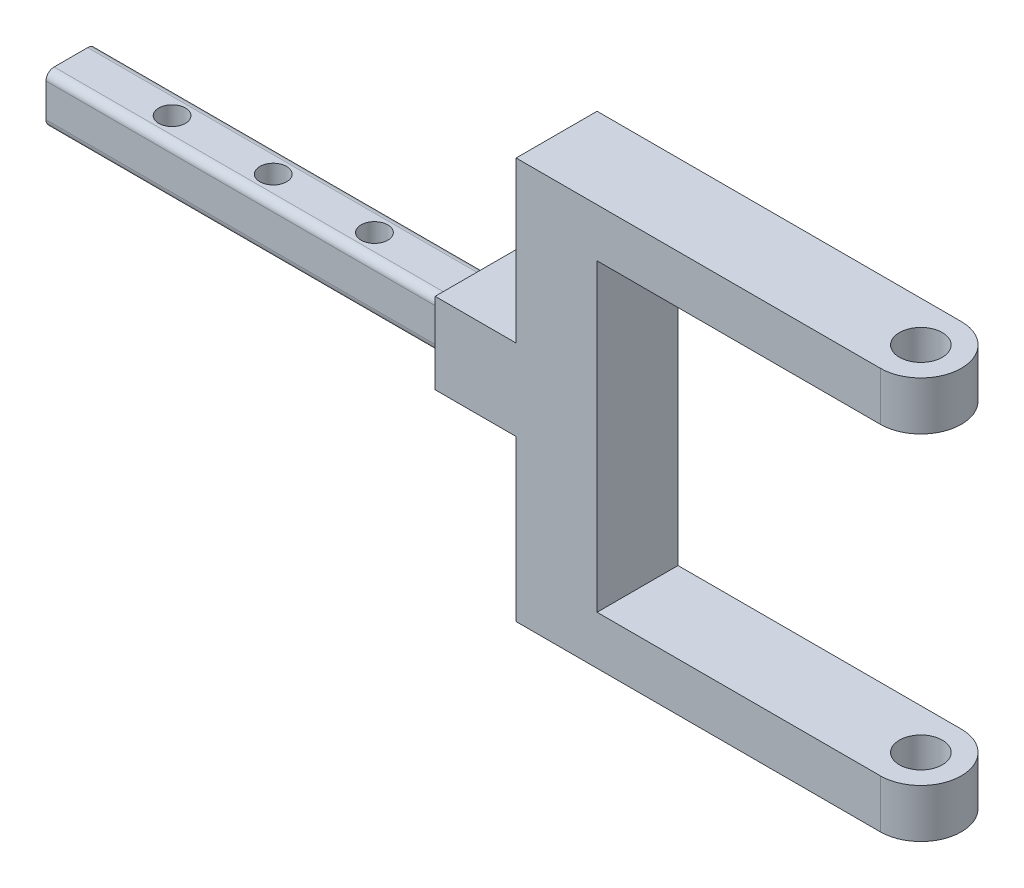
ISO-10303-21;
HEADER;
FILE_DESCRIPTION(('STEP AP214'),'2;1');
FILE_NAME('part.step','',(''),(''),'','','');
FILE_SCHEMA(('AUTOMOTIVE_DESIGN { 1 0 10303 214 1 1 1 1 }'));
ENDSEC;
DATA;
#1=APPLICATION_CONTEXT('core data for automotive mechanical design processes');
#2=APPLICATION_PROTOCOL_DEFINITION('international standard','automotive_design',2000,#1);
#3=PRODUCT_CONTEXT('',#1,'mechanical');
#4=PRODUCT('Part','Part','',(#3));
#5=PRODUCT_RELATED_PRODUCT_CATEGORY('part','',(#4));
#6=PRODUCT_DEFINITION_FORMATION('','',#4);
#7=PRODUCT_DEFINITION_CONTEXT('part definition',#1,'design');
#8=PRODUCT_DEFINITION('design','',#6,#7);
#9=PRODUCT_DEFINITION_SHAPE('','',#8);
#10=(LENGTH_UNIT() NAMED_UNIT(*) SI_UNIT(.MILLI.,.METRE.));
#11=(NAMED_UNIT(*) PLANE_ANGLE_UNIT() SI_UNIT($,.RADIAN.));
#12=(NAMED_UNIT(*) SI_UNIT($,.STERADIAN.) SOLID_ANGLE_UNIT());
#13=UNCERTAINTY_MEASURE_WITH_UNIT(LENGTH_MEASURE(1.E-05),#10,'distance_accuracy_value','');
#14=(GEOMETRIC_REPRESENTATION_CONTEXT(3) GLOBAL_UNCERTAINTY_ASSIGNED_CONTEXT((#13)) GLOBAL_UNIT_ASSIGNED_CONTEXT((#10,
#11,#12)) REPRESENTATION_CONTEXT('',''));
#15=CARTESIAN_POINT('',(0.,0.,0.));
#16=DIRECTION('',(0.,0.,1.));
#17=DIRECTION('',(1.,0.,0.));
#18=AXIS2_PLACEMENT_3D('',#15,#16,#17);
#19=CARTESIAN_POINT('',(40.,24.8,10.));
#20=DIRECTION('',(0.,-1.,0.));
#21=DIRECTION('',(1.,0.,0.));
#22=AXIS2_PLACEMENT_3D('',#19,#20,#21);
#23=PLANE('',#22);
#24=CARTESIAN_POINT('',(35.,24.8,5.));
#25=DIRECTION('',(0.,1.,0.));
#26=DIRECTION('',(-1.,0.,0.));
#27=AXIS2_PLACEMENT_3D('',#24,#25,#26);
#28=CIRCLE('',#27,2.65);
#29=CARTESIAN_POINT('',(32.35,24.8,5.));
#30=VERTEX_POINT('',#29);
#31=EDGE_CURVE('E415',#30,#30,#28,.T.);
#32=ORIENTED_EDGE('',*,*,#31,.F.);
#33=EDGE_LOOP('',(#32));
#34=FACE_BOUND('',#33,.T.);
#35=DIRECTION('',(-1.,0.,0.));
#36=VECTOR('',#35,1.);
#37=CARTESIAN_POINT('',(40.,24.8,10.));
#38=LINE('',#37,#36);
#39=CARTESIAN_POINT('',(35.,24.8,10.));
#40=VERTEX_POINT('',#39);
#41=CARTESIAN_POINT('',(-10.,24.8,10.));
#42=VERTEX_POINT('',#41);
#43=EDGE_CURVE('E268',#40,#42,#38,.T.);
#44=ORIENTED_EDGE('',*,*,#43,.F.);
#45=CARTESIAN_POINT('',(35.,24.8,5.));
#46=DIRECTION('',(0.,1.,0.));
#47=DIRECTION('',(-1.,0.,0.));
#48=AXIS2_PLACEMENT_3D('',#45,#46,#47);
#49=CIRCLE('',#48,5.);
#50=CARTESIAN_POINT('',(35.,24.8,0.));
#51=VERTEX_POINT('',#50);
#52=EDGE_CURVE('E225',#40,#51,#49,.T.);
#53=ORIENTED_EDGE('',*,*,#52,.T.);
#54=DIRECTION('',(-1.,0.,0.));
#55=VECTOR('',#54,1.);
#56=CARTESIAN_POINT('',(40.,24.8,0.));
#57=LINE('',#56,#55);
#58=CARTESIAN_POINT('',(-10.,24.8,0.));
#59=VERTEX_POINT('',#58);
#60=EDGE_CURVE('E254',#51,#59,#57,.T.);
#61=ORIENTED_EDGE('',*,*,#60,.T.);
#62=DIRECTION('',(0.,0.,-1.));
#63=VECTOR('',#62,1.);
#64=CARTESIAN_POINT('',(-10.,24.8,10.));
#65=LINE('',#64,#63);
#66=EDGE_CURVE('E276',#42,#59,#65,.T.);
#67=ORIENTED_EDGE('',*,*,#66,.F.);
#68=EDGE_LOOP('',(#44,#53,#61,#67));
#69=FACE_BOUND('',#68,.T.);
#70=ADVANCED_FACE('F78',(#34,#69),#23,.F.);
#71=CARTESIAN_POINT('',(-9.99999999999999,-24.8,10.));
#72=DIRECTION('',(0.,1.,0.));
#73=DIRECTION('',(-1.,0.,0.));
#74=AXIS2_PLACEMENT_3D('',#71,#72,#73);
#75=PLANE('',#74);
#76=CARTESIAN_POINT('',(35.,-24.8,5.));
#77=DIRECTION('',(0.,1.,0.));
#78=DIRECTION('',(-1.,0.,0.));
#79=AXIS2_PLACEMENT_3D('',#76,#77,#78);
#80=CIRCLE('',#79,2.65);
#81=CARTESIAN_POINT('',(32.35,-24.8,5.));
#82=VERTEX_POINT('',#81);
#83=EDGE_CURVE('E418',#82,#82,#80,.T.);
#84=ORIENTED_EDGE('',*,*,#83,.T.);
#85=EDGE_LOOP('',(#84));
#86=FACE_BOUND('',#85,.T.);
#87=CARTESIAN_POINT('',(35.,-24.8,5.));
#88=DIRECTION('',(0.,1.,0.));
#89=DIRECTION('',(-1.,0.,0.));
#90=AXIS2_PLACEMENT_3D('',#87,#88,#89);
#91=CIRCLE('',#90,5.);
#92=CARTESIAN_POINT('',(35.,-24.8,10.));
#93=VERTEX_POINT('',#92);
#94=CARTESIAN_POINT('',(35.,-24.8,0.));
#95=VERTEX_POINT('',#94);
#96=EDGE_CURVE('E214',#93,#95,#91,.T.);
#97=ORIENTED_EDGE('',*,*,#96,.F.);
#98=DIRECTION('',(1.,0.,0.));
#99=VECTOR('',#98,1.);
#100=CARTESIAN_POINT('',(-9.99999999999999,-24.8,10.));
#101=LINE('',#100,#99);
#102=CARTESIAN_POINT('',(-9.99999999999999,-24.8,10.));
#103=VERTEX_POINT('',#102);
#104=EDGE_CURVE('E219',#103,#93,#101,.T.);
#105=ORIENTED_EDGE('',*,*,#104,.F.);
#106=DIRECTION('',(0.,0.,-1.));
#107=VECTOR('',#106,1.);
#108=CARTESIAN_POINT('',(-9.99999999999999,-24.8,10.));
#109=LINE('',#108,#107);
#110=CARTESIAN_POINT('',(-9.99999999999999,-24.8,0.));
#111=VERTEX_POINT('',#110);
#112=EDGE_CURVE('E274',#103,#111,#109,.T.);
#113=ORIENTED_EDGE('',*,*,#112,.T.);
#114=DIRECTION('',(1.,0.,0.));
#115=VECTOR('',#114,1.);
#116=CARTESIAN_POINT('',(-9.99999999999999,-24.8,0.));
#117=LINE('',#116,#115);
#118=EDGE_CURVE('E221',#111,#95,#117,.T.);
#119=ORIENTED_EDGE('',*,*,#118,.T.);
#120=EDGE_LOOP('',(#97,#105,#113,#119));
#121=FACE_BOUND('',#120,.T.);
#122=ADVANCED_FACE('F216',(#86,#121),#75,.F.);
#123=CARTESIAN_POINT('',(40.,-18.8,10.));
#124=DIRECTION('',(0.,-1.,0.));
#125=DIRECTION('',(1.,0.,0.));
#126=AXIS2_PLACEMENT_3D('',#123,#124,#125);
#127=PLANE('',#126);
#128=CARTESIAN_POINT('',(35.,-18.8,5.));
#129=DIRECTION('',(0.,-1.,0.));
#130=DIRECTION('',(1.,0.,0.));
#131=AXIS2_PLACEMENT_3D('',#128,#129,#130);
#132=CIRCLE('',#131,2.65);
#133=CARTESIAN_POINT('',(37.65,-18.8,5.));
#134=VERTEX_POINT('',#133);
#135=EDGE_CURVE('E285',#134,#134,#132,.T.);
#136=ORIENTED_EDGE('',*,*,#135,.T.);
#137=EDGE_LOOP('',(#136));
#138=FACE_BOUND('',#137,.T.);
#139=DIRECTION('',(-1.,0.,0.));
#140=VECTOR('',#139,1.);
#141=CARTESIAN_POINT('',(40.,-18.8,10.));
#142=LINE('',#141,#140);
#143=CARTESIAN_POINT('',(35.,-18.8,10.));
#144=VERTEX_POINT('',#143);
#145=CARTESIAN_POINT('',(0.,-18.8,10.));
#146=VERTEX_POINT('',#145);
#147=EDGE_CURVE('E240',#144,#146,#142,.T.);
#148=ORIENTED_EDGE('',*,*,#147,.F.);
#149=CARTESIAN_POINT('',(35.,-18.8,5.));
#150=DIRECTION('',(0.,-1.,0.));
#151=DIRECTION('',(1.,0.,0.));
#152=AXIS2_PLACEMENT_3D('',#149,#150,#151);
#153=CIRCLE('',#152,5.);
#154=CARTESIAN_POINT('',(35.,-18.8,0.));
#155=VERTEX_POINT('',#154);
#156=EDGE_CURVE('E231',#155,#144,#153,.T.);
#157=ORIENTED_EDGE('',*,*,#156,.F.);
#158=DIRECTION('',(-1.,0.,0.));
#159=VECTOR('',#158,1.);
#160=CARTESIAN_POINT('',(40.,-18.8,0.));
#161=LINE('',#160,#159);
#162=CARTESIAN_POINT('',(0.,-18.8,0.));
#163=VERTEX_POINT('',#162);
#164=EDGE_CURVE('E261',#155,#163,#161,.T.);
#165=ORIENTED_EDGE('',*,*,#164,.T.);
#166=DIRECTION('',(0.,0.,-1.));
#167=VECTOR('',#166,1.);
#168=CARTESIAN_POINT('',(0.,-18.8,10.));
#169=LINE('',#168,#167);
#170=EDGE_CURVE('E271',#146,#163,#169,.T.);
#171=ORIENTED_EDGE('',*,*,#170,.F.);
#172=EDGE_LOOP('',(#148,#157,#165,#171));
#173=FACE_BOUND('',#172,.T.);
#174=ADVANCED_FACE('F429',(#138,#173),#127,.F.);
#175=CARTESIAN_POINT('',(0.,18.8,10.));
#176=DIRECTION('',(0.,1.,0.));
#177=DIRECTION('',(0.,0.,1.));
#178=AXIS2_PLACEMENT_3D('',#175,#176,#177);
#179=PLANE('',#178);
#180=CARTESIAN_POINT('',(35.,18.8,5.));
#181=DIRECTION('',(0.,1.,0.));
#182=DIRECTION('',(0.,0.,1.));
#183=AXIS2_PLACEMENT_3D('',#180,#181,#182);
#184=CIRCLE('',#183,2.65);
#185=CARTESIAN_POINT('',(35.,18.8,7.65));
#186=VERTEX_POINT('',#185);
#187=EDGE_CURVE('E282',#186,#186,#184,.T.);
#188=ORIENTED_EDGE('',*,*,#187,.T.);
#189=EDGE_LOOP('',(#188));
#190=FACE_BOUND('',#189,.T.);
#191=CARTESIAN_POINT('',(35.,18.8,5.));
#192=DIRECTION('',(0.,1.,0.));
#193=DIRECTION('',(0.,0.,1.));
#194=AXIS2_PLACEMENT_3D('',#191,#192,#193);
#195=CIRCLE('',#194,5.);
#196=CARTESIAN_POINT('',(35.,18.8,10.));
#197=VERTEX_POINT('',#196);
#198=CARTESIAN_POINT('',(35.,18.8,0.));
#199=VERTEX_POINT('',#198);
#200=EDGE_CURVE('E423',#197,#199,#195,.T.);
#201=ORIENTED_EDGE('',*,*,#200,.F.);
#202=DIRECTION('',(1.,0.,0.));
#203=VECTOR('',#202,1.);
#204=CARTESIAN_POINT('',(0.,18.8,10.));
#205=LINE('',#204,#203);
#206=CARTESIAN_POINT('',(0.,18.8,10.));
#207=VERTEX_POINT('',#206);
#208=EDGE_CURVE('E250',#207,#197,#205,.T.);
#209=ORIENTED_EDGE('',*,*,#208,.F.);
#210=DIRECTION('',(0.,0.,-1.));
#211=VECTOR('',#210,1.);
#212=CARTESIAN_POINT('',(0.,18.8,10.));
#213=LINE('',#212,#211);
#214=CARTESIAN_POINT('',(0.,18.8,0.));
#215=VERTEX_POINT('',#214);
#216=EDGE_CURVE('E253',#207,#215,#213,.T.);
#217=ORIENTED_EDGE('',*,*,#216,.T.);
#218=DIRECTION('',(1.,0.,0.));
#219=VECTOR('',#218,1.);
#220=CARTESIAN_POINT('',(0.,18.8,0.));
#221=LINE('',#220,#219);
#222=EDGE_CURVE('E265',#215,#199,#221,.T.);
#223=ORIENTED_EDGE('',*,*,#222,.T.);
#224=EDGE_LOOP('',(#201,#209,#217,#223));
#225=FACE_BOUND('',#224,.T.);
#226=ADVANCED_FACE('F504',(#190,#225),#179,.F.);
#227=CARTESIAN_POINT('',(0.,0.,10.));
#228=DIRECTION('',(0.,0.,1.));
#229=DIRECTION('',(1.,0.,0.));
#230=AXIS2_PLACEMENT_3D('',#227,#228,#229);
#231=PLANE('',#230);
#232=ORIENTED_EDGE('',*,*,#104,.T.);
#233=DIRECTION('',(0.,1.,0.));
#234=VECTOR('',#233,1.);
#235=CARTESIAN_POINT('',(35.,-24.8,10.));
#236=LINE('',#235,#234);
#237=EDGE_CURVE('E228',#93,#144,#236,.T.);
#238=ORIENTED_EDGE('',*,*,#237,.T.);
#239=ORIENTED_EDGE('',*,*,#147,.T.);
#240=DIRECTION('',(0.,1.,0.));
#241=VECTOR('',#240,1.);
#242=CARTESIAN_POINT('',(0.,18.8,10.));
#243=LINE('',#242,#241);
#244=EDGE_CURVE('E243',#146,#207,#243,.T.);
#245=ORIENTED_EDGE('',*,*,#244,.T.);
#246=ORIENTED_EDGE('',*,*,#208,.T.);
#247=DIRECTION('',(0.,1.,0.));
#248=VECTOR('',#247,1.);
#249=CARTESIAN_POINT('',(35.,-24.8,10.));
#250=LINE('',#249,#248);
#251=EDGE_CURVE('E281',#197,#40,#250,.T.);
#252=ORIENTED_EDGE('',*,*,#251,.T.);
#253=ORIENTED_EDGE('',*,*,#43,.T.);
#254=DIRECTION('',(0.,-1.,0.));
#255=VECTOR('',#254,1.);
#256=CARTESIAN_POINT('',(-10.,24.8,10.));
#257=LINE('',#256,#255);
#258=CARTESIAN_POINT('',(-10.,5.,10.));
#259=VERTEX_POINT('',#258);
#260=EDGE_CURVE('E241',#42,#259,#257,.T.);
#261=ORIENTED_EDGE('',*,*,#260,.T.);
#262=DIRECTION('',(1.,0.,0.));
#263=VECTOR('',#262,1.);
#264=CARTESIAN_POINT('',(-20.,5.,10.));
#265=LINE('',#264,#263);
#266=CARTESIAN_POINT('',(-20.,5.,10.));
#267=VERTEX_POINT('',#266);
#268=EDGE_CURVE('E379',#267,#259,#265,.T.);
#269=ORIENTED_EDGE('',*,*,#268,.F.);
#270=DIRECTION('',(0.,1.,0.));
#271=VECTOR('',#270,1.);
#272=CARTESIAN_POINT('',(-20.,0.,10.));
#273=LINE('',#272,#271);
#274=CARTESIAN_POINT('',(-20.,-5.,10.));
#275=VERTEX_POINT('',#274);
#276=EDGE_CURVE('E368',#275,#267,#273,.T.);
#277=ORIENTED_EDGE('',*,*,#276,.F.);
#278=DIRECTION('',(1.,0.,0.));
#279=VECTOR('',#278,1.);
#280=CARTESIAN_POINT('',(-20.,-5.,10.));
#281=LINE('',#280,#279);
#282=CARTESIAN_POINT('',(-10.,-5.,10.));
#283=VERTEX_POINT('',#282);
#284=EDGE_CURVE('E382',#275,#283,#281,.T.);
#285=ORIENTED_EDGE('',*,*,#284,.T.);
#286=EDGE_CURVE('E238',#283,#103,#257,.T.);
#287=ORIENTED_EDGE('',*,*,#286,.T.);
#288=EDGE_LOOP('',(#232,#238,#239,#245,#246,#252,#253,#261,#269,#277,#285,#287));
#289=FACE_BOUND('',#288,.T.);
#290=ADVANCED_FACE('F236',(#289),#231,.T.);
#291=CARTESIAN_POINT('',(0.,0.,0.));
#292=DIRECTION('',(0.,0.,1.));
#293=DIRECTION('',(1.,0.,0.));
#294=AXIS2_PLACEMENT_3D('',#291,#292,#293);
#295=PLANE('',#294);
#296=DIRECTION('',(0.,1.,0.));
#297=VECTOR('',#296,1.);
#298=CARTESIAN_POINT('',(35.,-24.8,0.));
#299=LINE('',#298,#297);
#300=EDGE_CURVE('E224',#95,#155,#299,.T.);
#301=ORIENTED_EDGE('',*,*,#300,.F.);
#302=ORIENTED_EDGE('',*,*,#118,.F.);
#303=DIRECTION('',(0.,-1.,0.));
#304=VECTOR('',#303,1.);
#305=CARTESIAN_POINT('',(-10.,24.8,0.));
#306=LINE('',#305,#304);
#307=CARTESIAN_POINT('',(-10.,-5.,0.));
#308=VERTEX_POINT('',#307);
#309=EDGE_CURVE('E256',#308,#111,#306,.T.);
#310=ORIENTED_EDGE('',*,*,#309,.F.);
#311=DIRECTION('',(1.,0.,0.));
#312=VECTOR('',#311,1.);
#313=CARTESIAN_POINT('',(-20.,-5.,0.));
#314=LINE('',#313,#312);
#315=CARTESIAN_POINT('',(-20.,-5.,0.));
#316=VERTEX_POINT('',#315);
#317=EDGE_CURVE('E257',#316,#308,#314,.T.);
#318=ORIENTED_EDGE('',*,*,#317,.F.);
#319=DIRECTION('',(0.,-1.,0.));
#320=VECTOR('',#319,1.);
#321=CARTESIAN_POINT('',(-20.,0.,0.));
#322=LINE('',#321,#320);
#323=CARTESIAN_POINT('',(-20.,5.,0.));
#324=VERTEX_POINT('',#323);
#325=EDGE_CURVE('E362',#324,#316,#322,.T.);
#326=ORIENTED_EDGE('',*,*,#325,.F.);
#327=DIRECTION('',(1.,0.,0.));
#328=VECTOR('',#327,1.);
#329=CARTESIAN_POINT('',(-20.,5.,0.));
#330=LINE('',#329,#328);
#331=CARTESIAN_POINT('',(-10.,5.,0.));
#332=VERTEX_POINT('',#331);
#333=EDGE_CURVE('E373',#324,#332,#330,.T.);
#334=ORIENTED_EDGE('',*,*,#333,.T.);
#335=EDGE_CURVE('E258',#59,#332,#306,.T.);
#336=ORIENTED_EDGE('',*,*,#335,.F.);
#337=ORIENTED_EDGE('',*,*,#60,.F.);
#338=DIRECTION('',(0.,1.,0.));
#339=VECTOR('',#338,1.);
#340=CARTESIAN_POINT('',(35.,-24.8,0.));
#341=LINE('',#340,#339);
#342=EDGE_CURVE('E279',#199,#51,#341,.T.);
#343=ORIENTED_EDGE('',*,*,#342,.F.);
#344=ORIENTED_EDGE('',*,*,#222,.F.);
#345=DIRECTION('',(0.,1.,0.));
#346=VECTOR('',#345,1.);
#347=CARTESIAN_POINT('',(0.,18.8,0.));
#348=LINE('',#347,#346);
#349=EDGE_CURVE('E263',#163,#215,#348,.T.);
#350=ORIENTED_EDGE('',*,*,#349,.F.);
#351=ORIENTED_EDGE('',*,*,#164,.F.);
#352=EDGE_LOOP('',(#301,#302,#310,#318,#326,#334,#336,#337,#343,#344,#350,#351));
#353=FACE_BOUND('',#352,.T.);
#354=ADVANCED_FACE('F399',(#353),#295,.F.);
#355=CARTESIAN_POINT('',(-20.,0.,0.));
#356=DIRECTION('',(-1.,0.,0.));
#357=DIRECTION('',(0.,-1.,0.));
#358=AXIS2_PLACEMENT_3D('',#355,#356,#357);
#359=PLANE('',#358);
#360=ORIENTED_EDGE('',*,*,#325,.T.);
#361=DIRECTION('',(0.,0.,1.));
#362=VECTOR('',#361,1.);
#363=CARTESIAN_POINT('',(-20.,-5.,0.));
#364=LINE('',#363,#362);
#365=EDGE_CURVE('E365',#316,#275,#364,.T.);
#366=ORIENTED_EDGE('',*,*,#365,.T.);
#367=ORIENTED_EDGE('',*,*,#276,.T.);
#368=DIRECTION('',(0.,0.,1.));
#369=VECTOR('',#368,1.);
#370=CARTESIAN_POINT('',(-20.,5.,0.));
#371=LINE('',#370,#369);
#372=EDGE_CURVE('E370',#324,#267,#371,.T.);
#373=ORIENTED_EDGE('',*,*,#372,.F.);
#374=EDGE_LOOP('',(#360,#366,#367,#373));
#375=FACE_BOUND('',#374,.T.);
#376=DIRECTION('',(0.,1.,0.));
#377=VECTOR('',#376,1.);
#378=CARTESIAN_POINT('',(-20.,0.,8.075));
#379=LINE('',#378,#377);
#380=CARTESIAN_POINT('',(-20.,-2.07500000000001,8.075));
#381=VERTEX_POINT('',#380);
#382=CARTESIAN_POINT('',(-20.,2.075,8.075));
#383=VERTEX_POINT('',#382);
#384=EDGE_CURVE('E333',#381,#383,#379,.T.);
#385=ORIENTED_EDGE('',*,*,#384,.F.);
#386=CARTESIAN_POINT('',(-20.,-2.07500000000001,7.075));
#387=DIRECTION('',(-1.,0.,0.));
#388=DIRECTION('',(0.,-1.,0.));
#389=AXIS2_PLACEMENT_3D('',#386,#387,#388);
#390=CIRCLE('',#389,1.);
#391=CARTESIAN_POINT('',(-20.,-3.07500000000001,7.075));
#392=VERTEX_POINT('',#391);
#393=EDGE_CURVE('E86',#381,#392,#390,.F.);
#394=ORIENTED_EDGE('',*,*,#393,.T.);
#395=DIRECTION('',(0.,0.,-1.));
#396=VECTOR('',#395,1.);
#397=CARTESIAN_POINT('',(-20.,-3.07500000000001,0.));
#398=LINE('',#397,#396);
#399=CARTESIAN_POINT('',(-20.,-3.07500000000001,2.925));
#400=VERTEX_POINT('',#399);
#401=EDGE_CURVE('E357',#392,#400,#398,.T.);
#402=ORIENTED_EDGE('',*,*,#401,.T.);
#403=CARTESIAN_POINT('',(-20.,-2.07500000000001,2.925));
#404=DIRECTION('',(-1.,0.,0.));
#405=DIRECTION('',(0.,-1.,0.));
#406=AXIS2_PLACEMENT_3D('',#403,#404,#405);
#407=CIRCLE('',#406,1.);
#408=CARTESIAN_POINT('',(-20.,-2.07500000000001,1.925));
#409=VERTEX_POINT('',#408);
#410=EDGE_CURVE('E12',#400,#409,#407,.F.);
#411=ORIENTED_EDGE('',*,*,#410,.T.);
#412=DIRECTION('',(0.,1.,0.));
#413=VECTOR('',#412,1.);
#414=CARTESIAN_POINT('',(-20.,0.,1.925));
#415=LINE('',#414,#413);
#416=CARTESIAN_POINT('',(-20.,2.075,1.925));
#417=VERTEX_POINT('',#416);
#418=EDGE_CURVE('E324',#409,#417,#415,.T.);
#419=ORIENTED_EDGE('',*,*,#418,.T.);
#420=CARTESIAN_POINT('',(-20.,2.075,2.925));
#421=DIRECTION('',(-1.,0.,0.));
#422=DIRECTION('',(0.,-1.,0.));
#423=AXIS2_PLACEMENT_3D('',#420,#421,#422);
#424=CIRCLE('',#423,1.);
#425=CARTESIAN_POINT('',(-20.,3.075,2.925));
#426=VERTEX_POINT('',#425);
#427=EDGE_CURVE('E317',#417,#426,#424,.F.);
#428=ORIENTED_EDGE('',*,*,#427,.T.);
#429=DIRECTION('',(0.,0.,-1.));
#430=VECTOR('',#429,1.);
#431=CARTESIAN_POINT('',(-20.,3.075,0.));
#432=LINE('',#431,#430);
#433=CARTESIAN_POINT('',(-20.,3.075,7.075));
#434=VERTEX_POINT('',#433);
#435=EDGE_CURVE('E322',#434,#426,#432,.T.);
#436=ORIENTED_EDGE('',*,*,#435,.F.);
#437=CARTESIAN_POINT('',(-20.,2.075,7.075));
#438=DIRECTION('',(-1.,0.,0.));
#439=DIRECTION('',(0.,-1.,0.));
#440=AXIS2_PLACEMENT_3D('',#437,#438,#439);
#441=CIRCLE('',#440,1.);
#442=EDGE_CURVE('E315',#434,#383,#441,.F.);
#443=ORIENTED_EDGE('',*,*,#442,.T.);
#444=EDGE_LOOP('',(#385,#394,#402,#411,#419,#428,#436,#443));
#445=FACE_BOUND('',#444,.T.);
#446=ADVANCED_FACE('F321',(#375,#445),#359,.T.);
#447=CARTESIAN_POINT('',(-10.,24.8,10.));
#448=DIRECTION('',(1.,0.,0.));
#449=DIRECTION('',(0.,1.,0.));
#450=AXIS2_PLACEMENT_3D('',#447,#448,#449);
#451=PLANE('',#450);
#452=DIRECTION('',(0.,0.,1.));
#453=VECTOR('',#452,1.);
#454=CARTESIAN_POINT('',(-10.,-5.,0.));
#455=LINE('',#454,#453);
#456=EDGE_CURVE('E356',#308,#283,#455,.T.);
#457=ORIENTED_EDGE('',*,*,#456,.F.);
#458=ORIENTED_EDGE('',*,*,#309,.T.);
#459=ORIENTED_EDGE('',*,*,#112,.F.);
#460=ORIENTED_EDGE('',*,*,#286,.F.);
#461=EDGE_LOOP('',(#457,#458,#459,#460));
#462=FACE_BOUND('',#461,.T.);
#463=ADVANCED_FACE('F412',(#462),#451,.F.);
#464=ORIENTED_EDGE('',*,*,#335,.T.);
#465=DIRECTION('',(0.,0.,1.));
#466=VECTOR('',#465,1.);
#467=CARTESIAN_POINT('',(-10.,5.,0.));
#468=LINE('',#467,#466);
#469=EDGE_CURVE('E366',#332,#259,#468,.T.);
#470=ORIENTED_EDGE('',*,*,#469,.T.);
#471=ORIENTED_EDGE('',*,*,#260,.F.);
#472=ORIENTED_EDGE('',*,*,#66,.T.);
#473=EDGE_LOOP('',(#464,#470,#471,#472));
#474=FACE_BOUND('',#473,.T.);
#475=ADVANCED_FACE('F393',(#474),#451,.F.);
#476=CARTESIAN_POINT('',(0.,18.8,10.));
#477=DIRECTION('',(-1.,0.,0.));
#478=DIRECTION('',(0.,-1.,0.));
#479=AXIS2_PLACEMENT_3D('',#476,#477,#478);
#480=PLANE('',#479);
#481=ORIENTED_EDGE('',*,*,#349,.T.);
#482=ORIENTED_EDGE('',*,*,#216,.F.);
#483=ORIENTED_EDGE('',*,*,#244,.F.);
#484=ORIENTED_EDGE('',*,*,#170,.T.);
#485=EDGE_LOOP('',(#481,#482,#483,#484));
#486=FACE_BOUND('',#485,.T.);
#487=ADVANCED_FACE('F501',(#486),#480,.F.);
#488=CARTESIAN_POINT('',(-20.,-5.,0.));
#489=DIRECTION('',(0.,1.,0.));
#490=DIRECTION('',(-1.,0.,0.));
#491=AXIS2_PLACEMENT_3D('',#488,#489,#490);
#492=PLANE('',#491);
#493=ORIENTED_EDGE('',*,*,#456,.T.);
#494=ORIENTED_EDGE('',*,*,#284,.F.);
#495=ORIENTED_EDGE('',*,*,#365,.F.);
#496=ORIENTED_EDGE('',*,*,#317,.T.);
#497=EDGE_LOOP('',(#493,#494,#495,#496));
#498=FACE_BOUND('',#497,.T.);
#499=ADVANCED_FACE('F409',(#498),#492,.F.);
#500=CARTESIAN_POINT('',(-20.,5.,0.));
#501=DIRECTION('',(0.,1.,0.));
#502=DIRECTION('',(-1.,0.,0.));
#503=AXIS2_PLACEMENT_3D('',#500,#501,#502);
#504=PLANE('',#503);
#505=ORIENTED_EDGE('',*,*,#469,.F.);
#506=ORIENTED_EDGE('',*,*,#333,.F.);
#507=ORIENTED_EDGE('',*,*,#372,.T.);
#508=ORIENTED_EDGE('',*,*,#268,.T.);
#509=EDGE_LOOP('',(#505,#506,#507,#508));
#510=FACE_BOUND('',#509,.T.);
#511=ADVANCED_FACE('F404',(#510),#504,.T.);
#512=CARTESIAN_POINT('',(-70.,-3.07500000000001,0.));
#513=DIRECTION('',(0.,-1.,0.));
#514=DIRECTION('',(1.,0.,0.));
#515=AXIS2_PLACEMENT_3D('',#512,#513,#514);
#516=PLANE('',#515);
#517=CARTESIAN_POINT('',(-57.5,-3.07500000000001,5.));
#518=DIRECTION('',(0.,-1.,0.));
#519=DIRECTION('',(1.,0.,0.));
#520=AXIS2_PLACEMENT_3D('',#517,#518,#519);
#521=CIRCLE('',#520,1.65);
#522=CARTESIAN_POINT('',(-55.85,-3.07500000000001,5.));
#523=VERTEX_POINT('',#522);
#524=EDGE_CURVE('E234',#523,#523,#521,.T.);
#525=ORIENTED_EDGE('',*,*,#524,.F.);
#526=EDGE_LOOP('',(#525));
#527=FACE_BOUND('',#526,.T.);
#528=CARTESIAN_POINT('',(-32.5,-3.07500000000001,5.));
#529=DIRECTION('',(0.,-1.,0.));
#530=DIRECTION('',(1.,0.,0.));
#531=AXIS2_PLACEMENT_3D('',#528,#529,#530);
#532=CIRCLE('',#531,1.65);
#533=CARTESIAN_POINT('',(-30.85,-3.07500000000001,5.));
#534=VERTEX_POINT('',#533);
#535=EDGE_CURVE('E708',#534,#534,#532,.T.);
#536=ORIENTED_EDGE('',*,*,#535,.F.);
#537=EDGE_LOOP('',(#536));
#538=FACE_BOUND('',#537,.T.);
#539=CARTESIAN_POINT('',(-45.,-3.07500000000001,5.));
#540=DIRECTION('',(0.,-1.,0.));
#541=DIRECTION('',(1.,0.,0.));
#542=AXIS2_PLACEMENT_3D('',#539,#540,#541);
#543=CIRCLE('',#542,1.65);
#544=CARTESIAN_POINT('',(-43.35,-3.07500000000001,5.));
#545=VERTEX_POINT('',#544);
#546=EDGE_CURVE('E717',#545,#545,#543,.T.);
#547=ORIENTED_EDGE('',*,*,#546,.F.);
#548=EDGE_LOOP('',(#547));
#549=FACE_BOUND('',#548,.T.);
#550=ORIENTED_EDGE('',*,*,#401,.F.);
#551=DIRECTION('',(1.,0.,0.));
#552=VECTOR('',#551,1.);
#553=CARTESIAN_POINT('',(-70.,-3.07500000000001,7.075));
#554=LINE('',#553,#552);
#555=CARTESIAN_POINT('',(-70.,-3.07500000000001,7.075));
#556=VERTEX_POINT('',#555);
#557=EDGE_CURVE('E313',#392,#556,#554,.F.);
#558=ORIENTED_EDGE('',*,*,#557,.T.);
#559=DIRECTION('',(0.,0.,-1.));
#560=VECTOR('',#559,1.);
#561=CARTESIAN_POINT('',(-70.,-3.07500000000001,0.));
#562=LINE('',#561,#560);
#563=CARTESIAN_POINT('',(-70.,-3.07500000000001,2.925));
#564=VERTEX_POINT('',#563);
#565=EDGE_CURVE('E347',#556,#564,#562,.T.);
#566=ORIENTED_EDGE('',*,*,#565,.T.);
#567=DIRECTION('',(1.,0.,0.));
#568=VECTOR('',#567,1.);
#569=CARTESIAN_POINT('',(-70.,-3.07500000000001,2.925));
#570=LINE('',#569,#568);
#571=EDGE_CURVE('E311',#564,#400,#570,.T.);
#572=ORIENTED_EDGE('',*,*,#571,.T.);
#573=EDGE_LOOP('',(#550,#558,#566,#572));
#574=FACE_BOUND('',#573,.T.);
#575=ADVANCED_FACE('F482',(#527,#538,#549,#574),#516,.T.);
#576=CARTESIAN_POINT('',(-70.,0.,8.075));
#577=DIRECTION('',(0.,0.,-1.));
#578=DIRECTION('',(0.,1.,0.));
#579=AXIS2_PLACEMENT_3D('',#576,#577,#578);
#580=PLANE('',#579);
#581=ORIENTED_EDGE('',*,*,#384,.T.);
#582=DIRECTION('',(1.,0.,0.));
#583=VECTOR('',#582,1.);
#584=CARTESIAN_POINT('',(-70.,2.07499999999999,8.075));
#585=LINE('',#584,#583);
#586=CARTESIAN_POINT('',(-70.,2.07499999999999,8.075));
#587=VERTEX_POINT('',#586);
#588=EDGE_CURVE('E296',#383,#587,#585,.F.);
#589=ORIENTED_EDGE('',*,*,#588,.T.);
#590=DIRECTION('',(0.,1.,0.));
#591=VECTOR('',#590,1.);
#592=CARTESIAN_POINT('',(-70.,0.,8.075));
#593=LINE('',#592,#591);
#594=CARTESIAN_POINT('',(-70.,-2.07500000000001,8.075));
#595=VERTEX_POINT('',#594);
#596=EDGE_CURVE('E349',#595,#587,#593,.T.);
#597=ORIENTED_EDGE('',*,*,#596,.F.);
#598=DIRECTION('',(1.,0.,0.));
#599=VECTOR('',#598,1.);
#600=CARTESIAN_POINT('',(-20.,-2.07500000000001,8.075));
#601=LINE('',#600,#599);
#602=EDGE_CURVE('E293',#595,#381,#601,.T.);
#603=ORIENTED_EDGE('',*,*,#602,.T.);
#604=EDGE_LOOP('',(#581,#589,#597,#603));
#605=FACE_BOUND('',#604,.T.);
#606=ADVANCED_FACE('F479',(#605),#580,.F.);
#607=CARTESIAN_POINT('',(-70.,3.07499999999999,0.));
#608=DIRECTION('',(0.,-1.,0.));
#609=DIRECTION('',(1.,0.,0.));
#610=AXIS2_PLACEMENT_3D('',#607,#608,#609);
#611=PLANE('',#610);
#612=CARTESIAN_POINT('',(-57.5,3.07499999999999,5.));
#613=DIRECTION('',(0.,1.,0.));
#614=DIRECTION('',(-1.,0.,0.));
#615=AXIS2_PLACEMENT_3D('',#612,#613,#614);
#616=CIRCLE('',#615,1.65);
#617=CARTESIAN_POINT('',(-59.15,3.07499999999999,5.));
#618=VERTEX_POINT('',#617);
#619=EDGE_CURVE('E714',#618,#618,#616,.T.);
#620=ORIENTED_EDGE('',*,*,#619,.F.);
#621=EDGE_LOOP('',(#620));
#622=FACE_BOUND('',#621,.T.);
#623=CARTESIAN_POINT('',(-32.5,3.075,5.));
#624=DIRECTION('',(0.,1.,0.));
#625=DIRECTION('',(-1.,0.,0.));
#626=AXIS2_PLACEMENT_3D('',#623,#624,#625);
#627=CIRCLE('',#626,1.65);
#628=CARTESIAN_POINT('',(-34.15,3.075,5.));
#629=VERTEX_POINT('',#628);
#630=EDGE_CURVE('E711',#629,#629,#627,.T.);
#631=ORIENTED_EDGE('',*,*,#630,.F.);
#632=EDGE_LOOP('',(#631));
#633=FACE_BOUND('',#632,.T.);
#634=CARTESIAN_POINT('',(-45.,3.07499999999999,5.));
#635=DIRECTION('',(0.,1.,0.));
#636=DIRECTION('',(-1.,0.,0.));
#637=AXIS2_PLACEMENT_3D('',#634,#635,#636);
#638=CIRCLE('',#637,1.65);
#639=CARTESIAN_POINT('',(-46.65,3.07499999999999,5.));
#640=VERTEX_POINT('',#639);
#641=EDGE_CURVE('E713',#640,#640,#638,.T.);
#642=ORIENTED_EDGE('',*,*,#641,.F.);
#643=EDGE_LOOP('',(#642));
#644=FACE_BOUND('',#643,.T.);
#645=DIRECTION('',(0.,0.,-1.));
#646=VECTOR('',#645,1.);
#647=CARTESIAN_POINT('',(-70.,3.07499999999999,0.));
#648=LINE('',#647,#646);
#649=CARTESIAN_POINT('',(-70.,3.07499999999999,7.075));
#650=VERTEX_POINT('',#649);
#651=CARTESIAN_POINT('',(-70.,3.07499999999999,2.925));
#652=VERTEX_POINT('',#651);
#653=EDGE_CURVE('E344',#650,#652,#648,.T.);
#654=ORIENTED_EDGE('',*,*,#653,.F.);
#655=DIRECTION('',(1.,0.,0.));
#656=VECTOR('',#655,1.);
#657=CARTESIAN_POINT('',(-70.,3.07499999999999,7.075));
#658=LINE('',#657,#656);
#659=EDGE_CURVE('E290',#650,#434,#658,.T.);
#660=ORIENTED_EDGE('',*,*,#659,.T.);
#661=ORIENTED_EDGE('',*,*,#435,.T.);
#662=DIRECTION('',(1.,0.,0.));
#663=VECTOR('',#662,1.);
#664=CARTESIAN_POINT('',(-70.,3.07499999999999,2.925));
#665=LINE('',#664,#663);
#666=EDGE_CURVE('E288',#426,#652,#665,.F.);
#667=ORIENTED_EDGE('',*,*,#666,.T.);
#668=EDGE_LOOP('',(#654,#660,#661,#667));
#669=FACE_BOUND('',#668,.T.);
#670=ADVANCED_FACE('F330',(#622,#633,#644,#669),#611,.F.);
#671=CARTESIAN_POINT('',(-70.,0.,1.925));
#672=DIRECTION('',(0.,0.,-1.));
#673=DIRECTION('',(0.,1.,0.));
#674=AXIS2_PLACEMENT_3D('',#671,#672,#673);
#675=PLANE('',#674);
#676=DIRECTION('',(0.,1.,0.));
#677=VECTOR('',#676,1.);
#678=CARTESIAN_POINT('',(-70.,0.,1.925));
#679=LINE('',#678,#677);
#680=CARTESIAN_POINT('',(-70.,-2.07500000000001,1.925));
#681=VERTEX_POINT('',#680);
#682=CARTESIAN_POINT('',(-70.,2.07499999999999,1.925));
#683=VERTEX_POINT('',#682);
#684=EDGE_CURVE('E342',#681,#683,#679,.T.);
#685=ORIENTED_EDGE('',*,*,#684,.T.);
#686=DIRECTION('',(1.,0.,0.));
#687=VECTOR('',#686,1.);
#688=CARTESIAN_POINT('',(-20.,2.075,1.925));
#689=LINE('',#688,#687);
#690=EDGE_CURVE('E308',#683,#417,#689,.T.);
#691=ORIENTED_EDGE('',*,*,#690,.T.);
#692=ORIENTED_EDGE('',*,*,#418,.F.);
#693=DIRECTION('',(1.,0.,0.));
#694=VECTOR('',#693,1.);
#695=CARTESIAN_POINT('',(-70.,-2.07500000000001,1.925));
#696=LINE('',#695,#694);
#697=EDGE_CURVE('E306',#409,#681,#696,.F.);
#698=ORIENTED_EDGE('',*,*,#697,.T.);
#699=EDGE_LOOP('',(#685,#691,#692,#698));
#700=FACE_BOUND('',#699,.T.);
#701=ADVANCED_FACE('F346',(#700),#675,.T.);
#702=CARTESIAN_POINT('',(-70.,0.,0.));
#703=DIRECTION('',(1.,0.,0.));
#704=DIRECTION('',(0.,1.,0.));
#705=AXIS2_PLACEMENT_3D('',#702,#703,#704);
#706=PLANE('',#705);
#707=ORIENTED_EDGE('',*,*,#596,.T.);
#708=CARTESIAN_POINT('',(-70.,2.07499999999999,7.075));
#709=DIRECTION('',(1.,0.,0.));
#710=DIRECTION('',(0.,1.,0.));
#711=AXIS2_PLACEMENT_3D('',#708,#709,#710);
#712=CIRCLE('',#711,1.);
#713=EDGE_CURVE('E304',#587,#650,#712,.F.);
#714=ORIENTED_EDGE('',*,*,#713,.T.);
#715=ORIENTED_EDGE('',*,*,#653,.T.);
#716=CARTESIAN_POINT('',(-70.,2.07499999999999,2.925));
#717=DIRECTION('',(1.,0.,0.));
#718=DIRECTION('',(0.,1.,0.));
#719=AXIS2_PLACEMENT_3D('',#716,#717,#718);
#720=CIRCLE('',#719,1.);
#721=EDGE_CURVE('E302',#652,#683,#720,.F.);
#722=ORIENTED_EDGE('',*,*,#721,.T.);
#723=ORIENTED_EDGE('',*,*,#684,.F.);
#724=CARTESIAN_POINT('',(-70.,-2.07500000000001,2.925));
#725=DIRECTION('',(1.,0.,0.));
#726=DIRECTION('',(0.,1.,0.));
#727=AXIS2_PLACEMENT_3D('',#724,#725,#726);
#728=CIRCLE('',#727,1.);
#729=EDGE_CURVE('E298',#681,#564,#728,.F.);
#730=ORIENTED_EDGE('',*,*,#729,.T.);
#731=ORIENTED_EDGE('',*,*,#565,.F.);
#732=CARTESIAN_POINT('',(-70.,-2.07500000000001,7.075));
#733=DIRECTION('',(1.,0.,0.));
#734=DIRECTION('',(0.,1.,0.));
#735=AXIS2_PLACEMENT_3D('',#732,#733,#734);
#736=CIRCLE('',#735,1.);
#737=EDGE_CURVE('E300',#556,#595,#736,.F.);
#738=ORIENTED_EDGE('',*,*,#737,.T.);
#739=EDGE_LOOP('',(#707,#714,#715,#722,#723,#730,#731,#738));
#740=FACE_BOUND('',#739,.T.);
#741=ADVANCED_FACE('F341',(#740),#706,.F.);
#742=CARTESIAN_POINT('',(35.,-24.8,5.));
#743=DIRECTION('',(0.,1.,0.));
#744=DIRECTION('',(-1.,0.,0.));
#745=AXIS2_PLACEMENT_3D('',#742,#743,#744);
#746=CYLINDRICAL_SURFACE('',#745,5.);
#747=ORIENTED_EDGE('',*,*,#200,.T.);
#748=ORIENTED_EDGE('',*,*,#342,.T.);
#749=ORIENTED_EDGE('',*,*,#52,.F.);
#750=ORIENTED_EDGE('',*,*,#251,.F.);
#751=EDGE_LOOP('',(#747,#748,#749,#750));
#752=FACE_BOUND('',#751,.T.);
#753=ADVANCED_FACE('F587',(#752),#746,.T.);
#754=ORIENTED_EDGE('',*,*,#156,.T.);
#755=ORIENTED_EDGE('',*,*,#237,.F.);
#756=ORIENTED_EDGE('',*,*,#96,.T.);
#757=ORIENTED_EDGE('',*,*,#300,.T.);
#758=EDGE_LOOP('',(#754,#755,#756,#757));
#759=FACE_BOUND('',#758,.T.);
#760=ADVANCED_FACE('F229',(#759),#746,.T.);
#761=CARTESIAN_POINT('',(35.,-24.8,5.));
#762=DIRECTION('',(0.,1.,0.));
#763=DIRECTION('',(-1.,0.,0.));
#764=AXIS2_PLACEMENT_3D('',#761,#762,#763);
#765=CYLINDRICAL_SURFACE('',#764,2.65);
#766=ORIENTED_EDGE('',*,*,#31,.T.);
#767=EDGE_LOOP('',(#766));
#768=FACE_BOUND('',#767,.T.);
#769=ORIENTED_EDGE('',*,*,#187,.F.);
#770=EDGE_LOOP('',(#769));
#771=FACE_BOUND('',#770,.T.);
#772=ADVANCED_FACE('F435',(#768,#771),#765,.F.);
#773=ORIENTED_EDGE('',*,*,#83,.F.);
#774=EDGE_LOOP('',(#773));
#775=FACE_BOUND('',#774,.T.);
#776=ORIENTED_EDGE('',*,*,#135,.F.);
#777=EDGE_LOOP('',(#776));
#778=FACE_BOUND('',#777,.T.);
#779=ADVANCED_FACE('F432',(#775,#778),#765,.F.);
#780=CARTESIAN_POINT('',(-45.,-24.8,5.));
#781=DIRECTION('',(0.,1.,0.));
#782=DIRECTION('',(-1.,0.,0.));
#783=AXIS2_PLACEMENT_3D('',#780,#781,#782);
#784=CYLINDRICAL_SURFACE('',#783,1.65);
#785=ORIENTED_EDGE('',*,*,#546,.T.);
#786=EDGE_LOOP('',(#785));
#787=FACE_BOUND('',#786,.T.);
#788=ORIENTED_EDGE('',*,*,#641,.T.);
#789=EDGE_LOOP('',(#788));
#790=FACE_BOUND('',#789,.T.);
#791=ADVANCED_FACE('F434',(#787,#790),#784,.F.);
#792=CARTESIAN_POINT('',(-32.5,-24.8,5.));
#793=DIRECTION('',(0.,1.,0.));
#794=DIRECTION('',(-1.,0.,0.));
#795=AXIS2_PLACEMENT_3D('',#792,#793,#794);
#796=CYLINDRICAL_SURFACE('',#795,1.65);
#797=ORIENTED_EDGE('',*,*,#535,.T.);
#798=EDGE_LOOP('',(#797));
#799=FACE_BOUND('',#798,.T.);
#800=ORIENTED_EDGE('',*,*,#630,.T.);
#801=EDGE_LOOP('',(#800));
#802=FACE_BOUND('',#801,.T.);
#803=ADVANCED_FACE('F442',(#799,#802),#796,.F.);
#804=CARTESIAN_POINT('',(-57.5,-24.8,5.));
#805=DIRECTION('',(0.,1.,0.));
#806=DIRECTION('',(-1.,0.,0.));
#807=AXIS2_PLACEMENT_3D('',#804,#805,#806);
#808=CYLINDRICAL_SURFACE('',#807,1.65);
#809=ORIENTED_EDGE('',*,*,#524,.T.);
#810=EDGE_LOOP('',(#809));
#811=FACE_BOUND('',#810,.T.);
#812=ORIENTED_EDGE('',*,*,#619,.T.);
#813=EDGE_LOOP('',(#812));
#814=FACE_BOUND('',#813,.T.);
#815=ADVANCED_FACE('F463',(#811,#814),#808,.F.);
#816=CARTESIAN_POINT('',(-70.,2.07499999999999,7.075));
#817=DIRECTION('',(1.,0.,0.));
#818=DIRECTION('',(0.,1.,0.));
#819=AXIS2_PLACEMENT_3D('',#816,#817,#818);
#820=CYLINDRICAL_SURFACE('',#819,1.);
#821=ORIENTED_EDGE('',*,*,#713,.F.);
#822=ORIENTED_EDGE('',*,*,#588,.F.);
#823=ORIENTED_EDGE('',*,*,#442,.F.);
#824=ORIENTED_EDGE('',*,*,#659,.F.);
#825=EDGE_LOOP('',(#821,#822,#823,#824));
#826=FACE_BOUND('',#825,.T.);
#827=ADVANCED_FACE('F460',(#826),#820,.T.);
#828=CARTESIAN_POINT('',(-70.,2.07499999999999,2.925));
#829=DIRECTION('',(-1.,0.,0.));
#830=DIRECTION('',(0.,-1.,0.));
#831=AXIS2_PLACEMENT_3D('',#828,#829,#830);
#832=CYLINDRICAL_SURFACE('',#831,1.);
#833=ORIENTED_EDGE('',*,*,#721,.F.);
#834=ORIENTED_EDGE('',*,*,#666,.F.);
#835=ORIENTED_EDGE('',*,*,#427,.F.);
#836=ORIENTED_EDGE('',*,*,#690,.F.);
#837=EDGE_LOOP('',(#833,#834,#835,#836));
#838=FACE_BOUND('',#837,.T.);
#839=ADVANCED_FACE('F336',(#838),#832,.T.);
#840=CARTESIAN_POINT('',(-70.,-2.07500000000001,7.075));
#841=DIRECTION('',(-1.,0.,0.));
#842=DIRECTION('',(0.,-1.,0.));
#843=AXIS2_PLACEMENT_3D('',#840,#841,#842);
#844=CYLINDRICAL_SURFACE('',#843,1.);
#845=ORIENTED_EDGE('',*,*,#737,.F.);
#846=ORIENTED_EDGE('',*,*,#557,.F.);
#847=ORIENTED_EDGE('',*,*,#393,.F.);
#848=ORIENTED_EDGE('',*,*,#602,.F.);
#849=EDGE_LOOP('',(#845,#846,#847,#848));
#850=FACE_BOUND('',#849,.T.);
#851=ADVANCED_FACE('F466',(#850),#844,.T.);
#852=CARTESIAN_POINT('',(-70.,-2.07500000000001,2.925));
#853=DIRECTION('',(1.,0.,0.));
#854=DIRECTION('',(0.,1.,0.));
#855=AXIS2_PLACEMENT_3D('',#852,#853,#854);
#856=CYLINDRICAL_SURFACE('',#855,1.);
#857=ORIENTED_EDGE('',*,*,#729,.F.);
#858=ORIENTED_EDGE('',*,*,#697,.F.);
#859=ORIENTED_EDGE('',*,*,#410,.F.);
#860=ORIENTED_EDGE('',*,*,#571,.F.);
#861=EDGE_LOOP('',(#857,#858,#859,#860));
#862=FACE_BOUND('',#861,.T.);
#863=ADVANCED_FACE('F80',(#862),#856,.T.);
#864=CLOSED_SHELL('',(#70,#122,#174,#226,#290,#354,#446,#463,#475,#487,#499,#511,#575,#606,#670,
#701,#741,#753,#760,#772,#779,#791,#803,#815,#827,#839,#851,#863));
#865=MANIFOLD_SOLID_BREP('B2',#864);
#866=ADVANCED_BREP_SHAPE_REPRESENTATION('',(#18,#865),#14);
#867=SHAPE_DEFINITION_REPRESENTATION(#9,#866);
ENDSEC;
END-ISO-10303-21;
